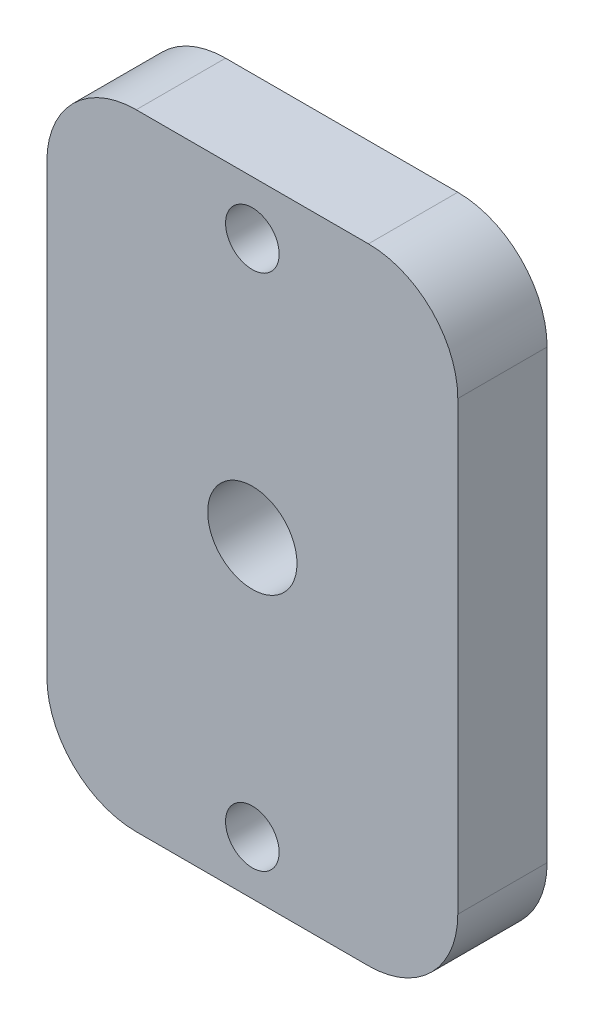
from build123d import *

# Parameters (mm, degrees)
ESQUISSE1_W        = 23
ESQUISSE1_H        = 35
ESQUISSE1_R        = 2.5
ESQUISSE1_R_2      = 1.5
BOSS_EXTRU_1_DEPTH = 5
CONG_1_R           = 5


with BuildPart() as part:
    # Esquisse1 → Boss.-Extru.1 (new body)
    with BuildSketch(Plane.XY):
        Rectangle(ESQUISSE1_W, ESQUISSE1_H)
        Circle(ESQUISSE1_R, mode=Mode.SUBTRACT)
        with Locations((0, 14.5)):
            Circle(ESQUISSE1_R_2, mode=Mode.SUBTRACT)
        with Locations((0, -14.5)):
            Circle(ESQUISSE1_R_2, mode=Mode.SUBTRACT)
    extrude(amount=BOSS_EXTRU_1_DEPTH)

    # Cong_1
    cong_1_edges = [part.edges().sort_by_distance(p)[0] for p in [
        (-11.5, 17.5, 2.5),
        (11.5, 17.5, 2.5),
        (11.5, -17.5, 2.5),
        (-11.5, -17.5, 2.5),
    ]]
    fillet(cong_1_edges, radius=CONG_1_R)


solid = part.part
